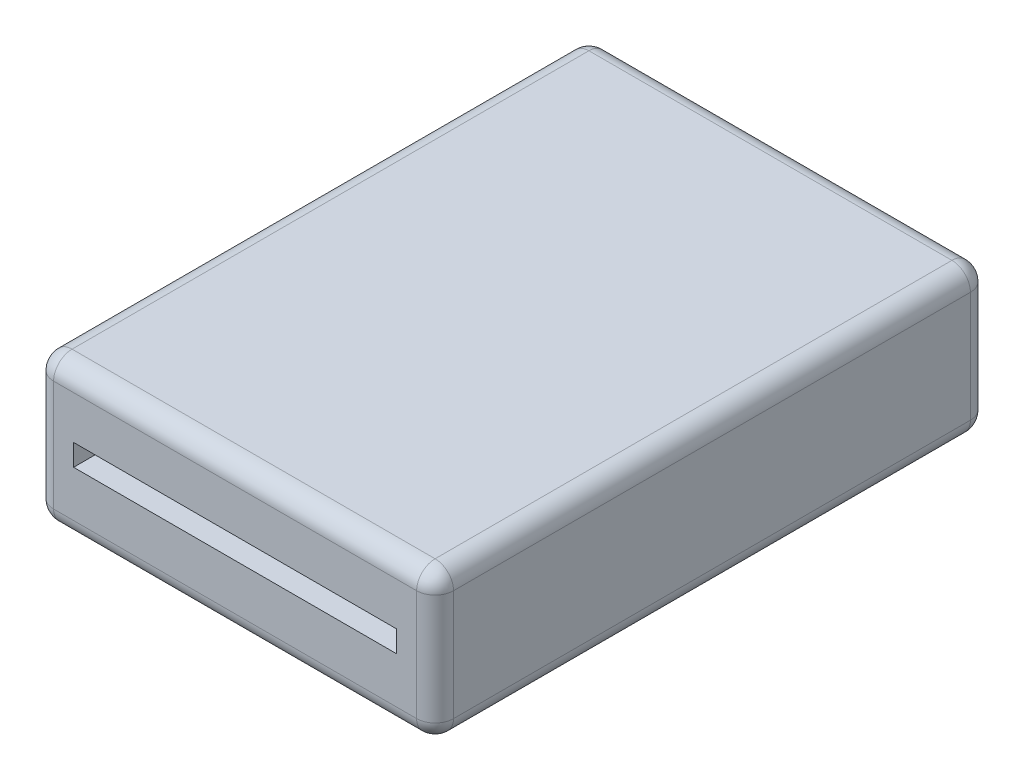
ISO-10303-21;
HEADER;
FILE_DESCRIPTION(('STEP AP214'),'2;1');
FILE_NAME('part.step','',(''),(''),'','','');
FILE_SCHEMA(('AUTOMOTIVE_DESIGN { 1 0 10303 214 1 1 1 1 }'));
ENDSEC;
DATA;
#1=APPLICATION_CONTEXT('core data for automotive mechanical design processes');
#2=APPLICATION_PROTOCOL_DEFINITION('international standard','automotive_design',2000,#1);
#3=PRODUCT_CONTEXT('',#1,'mechanical');
#4=PRODUCT('Part','Part','',(#3));
#5=PRODUCT_RELATED_PRODUCT_CATEGORY('part','',(#4));
#6=PRODUCT_DEFINITION_FORMATION('','',#4);
#7=PRODUCT_DEFINITION_CONTEXT('part definition',#1,'design');
#8=PRODUCT_DEFINITION('design','',#6,#7);
#9=PRODUCT_DEFINITION_SHAPE('','',#8);
#10=(LENGTH_UNIT() NAMED_UNIT(*) SI_UNIT(.MILLI.,.METRE.));
#11=(NAMED_UNIT(*) PLANE_ANGLE_UNIT() SI_UNIT($,.RADIAN.));
#12=(NAMED_UNIT(*) SI_UNIT($,.STERADIAN.) SOLID_ANGLE_UNIT());
#13=UNCERTAINTY_MEASURE_WITH_UNIT(LENGTH_MEASURE(1.E-05),#10,'distance_accuracy_value','');
#14=(GEOMETRIC_REPRESENTATION_CONTEXT(3) GLOBAL_UNCERTAINTY_ASSIGNED_CONTEXT((#13)) GLOBAL_UNIT_ASSIGNED_CONTEXT((#10,
#11,#12)) REPRESENTATION_CONTEXT('',''));
#15=CARTESIAN_POINT('',(0.,0.,0.));
#16=DIRECTION('',(0.,0.,1.));
#17=DIRECTION('',(1.,0.,0.));
#18=AXIS2_PLACEMENT_3D('',#15,#16,#17);
#19=CARTESIAN_POINT('',(29.5,24.,-42.));
#20=DIRECTION('',(0.,-1.,0.));
#21=DIRECTION('',(0.,0.,-1.));
#22=AXIS2_PLACEMENT_3D('',#19,#20,#21);
#23=CYLINDRICAL_SURFACE('',#22,3.);
#24=DIRECTION('',(0.,-1.,0.));
#25=VECTOR('',#24,1.);
#26=CARTESIAN_POINT('',(32.5,24.,-42.));
#27=LINE('',#26,#25);
#28=CARTESIAN_POINT('',(32.5,21.,-42.));
#29=VERTEX_POINT('',#28);
#30=CARTESIAN_POINT('',(32.5,3.,-42.));
#31=VERTEX_POINT('',#30);
#32=EDGE_CURVE('E187',#29,#31,#27,.T.);
#33=ORIENTED_EDGE('',*,*,#32,.T.);
#34=CARTESIAN_POINT('',(29.5,3.,-42.));
#35=DIRECTION('',(0.,-1.,0.));
#36=DIRECTION('',(0.,0.,-1.));
#37=AXIS2_PLACEMENT_3D('',#34,#35,#36);
#38=CIRCLE('',#37,3.);
#39=CARTESIAN_POINT('',(29.5,3.,-45.));
#40=VERTEX_POINT('',#39);
#41=EDGE_CURVE('E253',#31,#40,#38,.F.);
#42=ORIENTED_EDGE('',*,*,#41,.T.);
#43=DIRECTION('',(0.,-1.,0.));
#44=VECTOR('',#43,1.);
#45=CARTESIAN_POINT('',(29.5,24.,-45.));
#46=LINE('',#45,#44);
#47=CARTESIAN_POINT('',(29.5,21.,-45.));
#48=VERTEX_POINT('',#47);
#49=EDGE_CURVE('E209',#48,#40,#46,.T.);
#50=ORIENTED_EDGE('',*,*,#49,.F.);
#51=CARTESIAN_POINT('',(29.5,21.,-42.));
#52=DIRECTION('',(0.,-1.,0.));
#53=DIRECTION('',(0.,0.,-1.));
#54=AXIS2_PLACEMENT_3D('',#51,#52,#53);
#55=CIRCLE('',#54,3.);
#56=EDGE_CURVE('E251',#48,#29,#55,.T.);
#57=ORIENTED_EDGE('',*,*,#56,.T.);
#58=EDGE_LOOP('',(#33,#42,#50,#57));
#59=FACE_BOUND('',#58,.T.);
#60=ADVANCED_FACE('F34',(#59),#23,.T.);
#61=CARTESIAN_POINT('',(-29.5,24.,-45.));
#62=DIRECTION('',(0.,0.,1.));
#63=DIRECTION('',(1.,0.,0.));
#64=AXIS2_PLACEMENT_3D('',#61,#62,#63);
#65=PLANE('',#64);
#66=ORIENTED_EDGE('',*,*,#49,.T.);
#67=DIRECTION('',(-1.,0.,0.));
#68=VECTOR('',#67,1.);
#69=CARTESIAN_POINT('',(-29.5,3.,-45.));
#70=LINE('',#69,#68);
#71=CARTESIAN_POINT('',(-29.5,3.,-45.));
#72=VERTEX_POINT('',#71);
#73=EDGE_CURVE('E214',#40,#72,#70,.T.);
#74=ORIENTED_EDGE('',*,*,#73,.T.);
#75=DIRECTION('',(0.,-1.,0.));
#76=VECTOR('',#75,1.);
#77=CARTESIAN_POINT('',(-29.5,24.,-45.));
#78=LINE('',#77,#76);
#79=CARTESIAN_POINT('',(-29.5,21.,-45.));
#80=VERTEX_POINT('',#79);
#81=EDGE_CURVE('E206',#80,#72,#78,.T.);
#82=ORIENTED_EDGE('',*,*,#81,.F.);
#83=DIRECTION('',(-1.,0.,0.));
#84=VECTOR('',#83,1.);
#85=CARTESIAN_POINT('',(29.5,21.,-45.));
#86=LINE('',#85,#84);
#87=EDGE_CURVE('E212',#80,#48,#86,.F.);
#88=ORIENTED_EDGE('',*,*,#87,.T.);
#89=EDGE_LOOP('',(#66,#74,#82,#88));
#90=FACE_BOUND('',#89,.T.);
#91=ADVANCED_FACE('F325',(#90),#65,.F.);
#92=CARTESIAN_POINT('',(-29.5,24.,-42.));
#93=DIRECTION('',(0.,-1.,0.));
#94=DIRECTION('',(0.,0.,-1.));
#95=AXIS2_PLACEMENT_3D('',#92,#93,#94);
#96=CYLINDRICAL_SURFACE('',#95,3.);
#97=ORIENTED_EDGE('',*,*,#81,.T.);
#98=CARTESIAN_POINT('',(-29.5,3.,-42.));
#99=DIRECTION('',(0.,-1.,0.));
#100=DIRECTION('',(0.,0.,-1.));
#101=AXIS2_PLACEMENT_3D('',#98,#99,#100);
#102=CIRCLE('',#101,3.);
#103=CARTESIAN_POINT('',(-32.5,3.,-42.));
#104=VERTEX_POINT('',#103);
#105=EDGE_CURVE('E228',#72,#104,#102,.F.);
#106=ORIENTED_EDGE('',*,*,#105,.T.);
#107=DIRECTION('',(0.,-1.,0.));
#108=VECTOR('',#107,1.);
#109=CARTESIAN_POINT('',(-32.5,24.,-42.));
#110=LINE('',#109,#108);
#111=CARTESIAN_POINT('',(-32.5,21.,-42.));
#112=VERTEX_POINT('',#111);
#113=EDGE_CURVE('E203',#112,#104,#110,.T.);
#114=ORIENTED_EDGE('',*,*,#113,.F.);
#115=CARTESIAN_POINT('',(-29.5,21.,-42.));
#116=DIRECTION('',(0.,-1.,0.));
#117=DIRECTION('',(0.,0.,-1.));
#118=AXIS2_PLACEMENT_3D('',#115,#116,#117);
#119=CIRCLE('',#118,3.);
#120=EDGE_CURVE('E226',#112,#80,#119,.T.);
#121=ORIENTED_EDGE('',*,*,#120,.T.);
#122=EDGE_LOOP('',(#97,#106,#114,#121));
#123=FACE_BOUND('',#122,.T.);
#124=ADVANCED_FACE('F316',(#123),#96,.T.);
#125=CARTESIAN_POINT('',(-32.5,24.,42.));
#126=DIRECTION('',(1.,0.,0.));
#127=DIRECTION('',(0.,0.,-1.));
#128=AXIS2_PLACEMENT_3D('',#125,#126,#127);
#129=PLANE('',#128);
#130=ORIENTED_EDGE('',*,*,#113,.T.);
#131=DIRECTION('',(0.,0.,1.));
#132=VECTOR('',#131,1.);
#133=CARTESIAN_POINT('',(-32.5,3.,42.));
#134=LINE('',#133,#132);
#135=CARTESIAN_POINT('',(-32.5,3.,42.));
#136=VERTEX_POINT('',#135);
#137=EDGE_CURVE('E232',#104,#136,#134,.T.);
#138=ORIENTED_EDGE('',*,*,#137,.T.);
#139=DIRECTION('',(0.,-1.,0.));
#140=VECTOR('',#139,1.);
#141=CARTESIAN_POINT('',(-32.5,24.,42.));
#142=LINE('',#141,#140);
#143=CARTESIAN_POINT('',(-32.5,21.,42.));
#144=VERTEX_POINT('',#143);
#145=EDGE_CURVE('E200',#144,#136,#142,.T.);
#146=ORIENTED_EDGE('',*,*,#145,.F.);
#147=DIRECTION('',(0.,0.,1.));
#148=VECTOR('',#147,1.);
#149=CARTESIAN_POINT('',(-32.5,21.,-42.));
#150=LINE('',#149,#148);
#151=EDGE_CURVE('E230',#144,#112,#150,.F.);
#152=ORIENTED_EDGE('',*,*,#151,.T.);
#153=EDGE_LOOP('',(#130,#138,#146,#152));
#154=FACE_BOUND('',#153,.T.);
#155=ADVANCED_FACE('F313',(#154),#129,.F.);
#156=CARTESIAN_POINT('',(-29.5,24.,42.));
#157=DIRECTION('',(0.,-1.,0.));
#158=DIRECTION('',(0.,0.,-1.));
#159=AXIS2_PLACEMENT_3D('',#156,#157,#158);
#160=CYLINDRICAL_SURFACE('',#159,3.);
#161=ORIENTED_EDGE('',*,*,#145,.T.);
#162=CARTESIAN_POINT('',(-29.5,3.,42.));
#163=DIRECTION('',(0.,-1.,0.));
#164=DIRECTION('',(0.,0.,-1.));
#165=AXIS2_PLACEMENT_3D('',#162,#163,#164);
#166=CIRCLE('',#165,3.);
#167=CARTESIAN_POINT('',(-29.5,3.,45.));
#168=VERTEX_POINT('',#167);
#169=EDGE_CURVE('E236',#136,#168,#166,.F.);
#170=ORIENTED_EDGE('',*,*,#169,.T.);
#171=DIRECTION('',(0.,-1.,0.));
#172=VECTOR('',#171,1.);
#173=CARTESIAN_POINT('',(-29.5,24.,45.));
#174=LINE('',#173,#172);
#175=CARTESIAN_POINT('',(-29.5,21.,45.));
#176=VERTEX_POINT('',#175);
#177=EDGE_CURVE('E197',#176,#168,#174,.T.);
#178=ORIENTED_EDGE('',*,*,#177,.F.);
#179=CARTESIAN_POINT('',(-29.5,21.,42.));
#180=DIRECTION('',(0.,-1.,0.));
#181=DIRECTION('',(0.,0.,-1.));
#182=AXIS2_PLACEMENT_3D('',#179,#180,#181);
#183=CIRCLE('',#182,3.);
#184=EDGE_CURVE('E234',#176,#144,#183,.T.);
#185=ORIENTED_EDGE('',*,*,#184,.T.);
#186=EDGE_LOOP('',(#161,#170,#178,#185));
#187=FACE_BOUND('',#186,.T.);
#188=ADVANCED_FACE('F342',(#187),#160,.T.);
#189=CARTESIAN_POINT('',(-29.5,24.,45.));
#190=DIRECTION('',(0.,0.,-1.));
#191=DIRECTION('',(-1.,0.,0.));
#192=AXIS2_PLACEMENT_3D('',#189,#190,#191);
#193=PLANE('',#192);
#194=DIRECTION('',(-1.,0.,0.));
#195=VECTOR('',#194,1.);
#196=CARTESIAN_POINT('',(-26.25,13.9987751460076,45.));
#197=LINE('',#196,#195);
#198=CARTESIAN_POINT('',(26.25,13.9987751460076,45.));
#199=VERTEX_POINT('',#198);
#200=CARTESIAN_POINT('',(-26.25,13.9987751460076,45.));
#201=VERTEX_POINT('',#200);
#202=EDGE_CURVE('E177',#199,#201,#197,.T.);
#203=ORIENTED_EDGE('',*,*,#202,.F.);
#204=DIRECTION('',(0.,1.,0.));
#205=VECTOR('',#204,1.);
#206=CARTESIAN_POINT('',(26.25,13.9987751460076,45.));
#207=LINE('',#206,#205);
#208=CARTESIAN_POINT('',(26.25,10.4987751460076,45.));
#209=VERTEX_POINT('',#208);
#210=EDGE_CURVE('E51',#209,#199,#207,.T.);
#211=ORIENTED_EDGE('',*,*,#210,.F.);
#212=DIRECTION('',(1.,0.,0.));
#213=VECTOR('',#212,1.);
#214=CARTESIAN_POINT('',(-26.25,10.4987751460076,45.));
#215=LINE('',#214,#213);
#216=CARTESIAN_POINT('',(-26.25,10.4987751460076,45.));
#217=VERTEX_POINT('',#216);
#218=EDGE_CURVE('E168',#217,#209,#215,.T.);
#219=ORIENTED_EDGE('',*,*,#218,.F.);
#220=DIRECTION('',(0.,-1.,0.));
#221=VECTOR('',#220,1.);
#222=CARTESIAN_POINT('',(-26.25,13.9987751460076,45.));
#223=LINE('',#222,#221);
#224=EDGE_CURVE('E171',#201,#217,#223,.T.);
#225=ORIENTED_EDGE('',*,*,#224,.F.);
#226=EDGE_LOOP('',(#203,#211,#219,#225));
#227=FACE_BOUND('',#226,.T.);
#228=ORIENTED_EDGE('',*,*,#177,.T.);
#229=DIRECTION('',(1.,0.,0.));
#230=VECTOR('',#229,1.);
#231=CARTESIAN_POINT('',(-29.5,3.,45.));
#232=LINE('',#231,#230);
#233=CARTESIAN_POINT('',(29.5,3.,45.));
#234=VERTEX_POINT('',#233);
#235=EDGE_CURVE('E240',#168,#234,#232,.T.);
#236=ORIENTED_EDGE('',*,*,#235,.T.);
#237=DIRECTION('',(0.,-1.,0.));
#238=VECTOR('',#237,1.);
#239=CARTESIAN_POINT('',(29.5,24.,45.));
#240=LINE('',#239,#238);
#241=CARTESIAN_POINT('',(29.5,21.,45.));
#242=VERTEX_POINT('',#241);
#243=EDGE_CURVE('E194',#242,#234,#240,.T.);
#244=ORIENTED_EDGE('',*,*,#243,.F.);
#245=DIRECTION('',(1.,0.,0.));
#246=VECTOR('',#245,1.);
#247=CARTESIAN_POINT('',(-29.5,21.,45.));
#248=LINE('',#247,#246);
#249=EDGE_CURVE('E238',#242,#176,#248,.F.);
#250=ORIENTED_EDGE('',*,*,#249,.T.);
#251=EDGE_LOOP('',(#228,#236,#244,#250));
#252=FACE_BOUND('',#251,.T.);
#253=ADVANCED_FACE('F353',(#227,#252),#193,.F.);
#254=CARTESIAN_POINT('',(29.5,24.,42.));
#255=DIRECTION('',(0.,-1.,0.));
#256=DIRECTION('',(0.,0.,-1.));
#257=AXIS2_PLACEMENT_3D('',#254,#255,#256);
#258=CYLINDRICAL_SURFACE('',#257,3.);
#259=ORIENTED_EDGE('',*,*,#243,.T.);
#260=CARTESIAN_POINT('',(29.5,3.,42.));
#261=DIRECTION('',(0.,-1.,0.));
#262=DIRECTION('',(0.,0.,-1.));
#263=AXIS2_PLACEMENT_3D('',#260,#261,#262);
#264=CIRCLE('',#263,3.);
#265=CARTESIAN_POINT('',(32.5,3.,42.));
#266=VERTEX_POINT('',#265);
#267=EDGE_CURVE('E244',#234,#266,#264,.F.);
#268=ORIENTED_EDGE('',*,*,#267,.T.);
#269=DIRECTION('',(0.,-1.,0.));
#270=VECTOR('',#269,1.);
#271=CARTESIAN_POINT('',(32.5,24.,42.));
#272=LINE('',#271,#270);
#273=CARTESIAN_POINT('',(32.5,21.,42.));
#274=VERTEX_POINT('',#273);
#275=EDGE_CURVE('E190',#274,#266,#272,.T.);
#276=ORIENTED_EDGE('',*,*,#275,.F.);
#277=CARTESIAN_POINT('',(29.5,21.,42.));
#278=DIRECTION('',(0.,-1.,0.));
#279=DIRECTION('',(0.,0.,-1.));
#280=AXIS2_PLACEMENT_3D('',#277,#278,#279);
#281=CIRCLE('',#280,3.);
#282=EDGE_CURVE('E242',#274,#242,#281,.T.);
#283=ORIENTED_EDGE('',*,*,#282,.T.);
#284=EDGE_LOOP('',(#259,#268,#276,#283));
#285=FACE_BOUND('',#284,.T.);
#286=ADVANCED_FACE('F356',(#285),#258,.T.);
#287=CARTESIAN_POINT('',(32.5,24.,42.));
#288=DIRECTION('',(-1.,0.,0.));
#289=DIRECTION('',(0.,0.,1.));
#290=AXIS2_PLACEMENT_3D('',#287,#288,#289);
#291=PLANE('',#290);
#292=ORIENTED_EDGE('',*,*,#275,.T.);
#293=DIRECTION('',(0.,0.,-1.));
#294=VECTOR('',#293,1.);
#295=CARTESIAN_POINT('',(32.5,3.,42.));
#296=LINE('',#295,#294);
#297=EDGE_CURVE('E249',#266,#31,#296,.T.);
#298=ORIENTED_EDGE('',*,*,#297,.T.);
#299=ORIENTED_EDGE('',*,*,#32,.F.);
#300=DIRECTION('',(0.,0.,-1.));
#301=VECTOR('',#300,1.);
#302=CARTESIAN_POINT('',(32.5,21.,42.));
#303=LINE('',#302,#301);
#304=EDGE_CURVE('E246',#29,#274,#303,.F.);
#305=ORIENTED_EDGE('',*,*,#304,.T.);
#306=EDGE_LOOP('',(#292,#298,#299,#305));
#307=FACE_BOUND('',#306,.T.);
#308=ADVANCED_FACE('F366',(#307),#291,.F.);
#309=CARTESIAN_POINT('',(29.5,24.,-42.));
#310=DIRECTION('',(0.,1.,0.));
#311=DIRECTION('',(0.,0.,1.));
#312=AXIS2_PLACEMENT_3D('',#309,#310,#311);
#313=PLANE('',#312);
#314=DIRECTION('',(1.,0.,0.));
#315=VECTOR('',#314,1.);
#316=CARTESIAN_POINT('',(29.5,24.,42.));
#317=LINE('',#316,#315);
#318=CARTESIAN_POINT('',(-29.5,24.,42.));
#319=VERTEX_POINT('',#318);
#320=CARTESIAN_POINT('',(29.5,24.,42.));
#321=VERTEX_POINT('',#320);
#322=EDGE_CURVE('E43',#319,#321,#317,.T.);
#323=ORIENTED_EDGE('',*,*,#322,.T.);
#324=DIRECTION('',(0.,0.,-1.));
#325=VECTOR('',#324,1.);
#326=CARTESIAN_POINT('',(29.5,24.,-42.));
#327=LINE('',#326,#325);
#328=CARTESIAN_POINT('',(29.5,24.,-42.));
#329=VERTEX_POINT('',#328);
#330=EDGE_CURVE('E11',#321,#329,#327,.T.);
#331=ORIENTED_EDGE('',*,*,#330,.T.);
#332=DIRECTION('',(-1.,0.,0.));
#333=VECTOR('',#332,1.);
#334=CARTESIAN_POINT('',(-29.5,24.,-42.));
#335=LINE('',#334,#333);
#336=CARTESIAN_POINT('',(-29.5,24.,-42.));
#337=VERTEX_POINT('',#336);
#338=EDGE_CURVE('E255',#329,#337,#335,.T.);
#339=ORIENTED_EDGE('',*,*,#338,.T.);
#340=DIRECTION('',(0.,0.,1.));
#341=VECTOR('',#340,1.);
#342=CARTESIAN_POINT('',(-29.5,24.,42.));
#343=LINE('',#342,#341);
#344=EDGE_CURVE('E257',#337,#319,#343,.T.);
#345=ORIENTED_EDGE('',*,*,#344,.T.);
#346=EDGE_LOOP('',(#323,#331,#339,#345));
#347=FACE_BOUND('',#346,.T.);
#348=ADVANCED_FACE('F379',(#347),#313,.T.);
#349=CARTESIAN_POINT('',(29.5,0.,-42.));
#350=DIRECTION('',(0.,1.,0.));
#351=DIRECTION('',(0.,0.,1.));
#352=AXIS2_PLACEMENT_3D('',#349,#350,#351);
#353=PLANE('',#352);
#354=DIRECTION('',(0.,0.,1.));
#355=VECTOR('',#354,1.);
#356=CARTESIAN_POINT('',(-29.5,0.,-42.));
#357=LINE('',#356,#355);
#358=CARTESIAN_POINT('',(-29.5,0.,42.));
#359=VERTEX_POINT('',#358);
#360=CARTESIAN_POINT('',(-29.5,0.,-42.));
#361=VERTEX_POINT('',#360);
#362=EDGE_CURVE('E221',#359,#361,#357,.F.);
#363=ORIENTED_EDGE('',*,*,#362,.T.);
#364=DIRECTION('',(-1.,0.,0.));
#365=VECTOR('',#364,1.);
#366=CARTESIAN_POINT('',(29.5,0.,-42.));
#367=LINE('',#366,#365);
#368=CARTESIAN_POINT('',(29.5,0.,-42.));
#369=VERTEX_POINT('',#368);
#370=EDGE_CURVE('E223',#361,#369,#367,.F.);
#371=ORIENTED_EDGE('',*,*,#370,.T.);
#372=DIRECTION('',(0.,0.,-1.));
#373=VECTOR('',#372,1.);
#374=CARTESIAN_POINT('',(29.5,0.,-42.));
#375=LINE('',#374,#373);
#376=CARTESIAN_POINT('',(29.5,0.,42.));
#377=VERTEX_POINT('',#376);
#378=EDGE_CURVE('E217',#369,#377,#375,.F.);
#379=ORIENTED_EDGE('',*,*,#378,.T.);
#380=DIRECTION('',(1.,0.,0.));
#381=VECTOR('',#380,1.);
#382=CARTESIAN_POINT('',(29.5,0.,42.));
#383=LINE('',#382,#381);
#384=EDGE_CURVE('E219',#377,#359,#383,.F.);
#385=ORIENTED_EDGE('',*,*,#384,.T.);
#386=EDGE_LOOP('',(#363,#371,#379,#385));
#387=FACE_BOUND('',#386,.T.);
#388=ADVANCED_FACE('F332',(#387),#353,.F.);
#389=CARTESIAN_POINT('',(-29.5,3.,42.));
#390=DIRECTION('',(1.,0.,0.));
#391=DIRECTION('',(0.,0.,-1.));
#392=AXIS2_PLACEMENT_3D('',#389,#390,#391);
#393=CYLINDRICAL_SURFACE('',#392,3.);
#394=CARTESIAN_POINT('',(29.5,3.,42.));
#395=DIRECTION('',(1.,0.,0.));
#396=DIRECTION('',(0.,0.,-1.));
#397=AXIS2_PLACEMENT_3D('',#394,#395,#396);
#398=CIRCLE('',#397,3.);
#399=EDGE_CURVE('E191',#234,#377,#398,.T.);
#400=ORIENTED_EDGE('',*,*,#399,.F.);
#401=ORIENTED_EDGE('',*,*,#235,.F.);
#402=CARTESIAN_POINT('',(-29.5,3.,42.));
#403=DIRECTION('',(-1.,0.,0.));
#404=DIRECTION('',(0.,0.,1.));
#405=AXIS2_PLACEMENT_3D('',#402,#403,#404);
#406=CIRCLE('',#405,3.);
#407=EDGE_CURVE('E276',#359,#168,#406,.T.);
#408=ORIENTED_EDGE('',*,*,#407,.F.);
#409=ORIENTED_EDGE('',*,*,#384,.F.);
#410=EDGE_LOOP('',(#400,#401,#408,#409));
#411=FACE_BOUND('',#410,.T.);
#412=ADVANCED_FACE('F349',(#411),#393,.T.);
#413=CARTESIAN_POINT('',(29.5,3.,42.));
#414=DIRECTION('',(0.,1.,0.));
#415=DIRECTION('',(0.,0.,1.));
#416=AXIS2_PLACEMENT_3D('',#413,#414,#415);
#417=SPHERICAL_SURFACE('',#416,3.);
#418=ORIENTED_EDGE('',*,*,#267,.F.);
#419=ORIENTED_EDGE('',*,*,#399,.T.);
#420=CARTESIAN_POINT('',(29.5,3.,42.));
#421=DIRECTION('',(0.,0.,-1.));
#422=DIRECTION('',(-1.,0.,0.));
#423=AXIS2_PLACEMENT_3D('',#420,#421,#422);
#424=CIRCLE('',#423,3.);
#425=EDGE_CURVE('E273',#266,#377,#424,.T.);
#426=ORIENTED_EDGE('',*,*,#425,.F.);
#427=EDGE_LOOP('',(#418,#419,#426));
#428=FACE_BOUND('',#427,.T.);
#429=ADVANCED_FACE('F414',(#428),#417,.T.);
#430=CARTESIAN_POINT('',(-29.5,3.,42.));
#431=DIRECTION('',(0.,1.,0.));
#432=DIRECTION('',(0.,0.,1.));
#433=AXIS2_PLACEMENT_3D('',#430,#431,#432);
#434=SPHERICAL_SURFACE('',#433,3.);
#435=ORIENTED_EDGE('',*,*,#407,.T.);
#436=ORIENTED_EDGE('',*,*,#169,.F.);
#437=CARTESIAN_POINT('',(-29.5,3.,42.));
#438=DIRECTION('',(0.,0.,-1.));
#439=DIRECTION('',(-1.,0.,0.));
#440=AXIS2_PLACEMENT_3D('',#437,#438,#439);
#441=CIRCLE('',#440,3.);
#442=EDGE_CURVE('E270',#359,#136,#441,.T.);
#443=ORIENTED_EDGE('',*,*,#442,.F.);
#444=EDGE_LOOP('',(#435,#436,#443));
#445=FACE_BOUND('',#444,.T.);
#446=ADVANCED_FACE('F345',(#445),#434,.T.);
#447=CARTESIAN_POINT('',(29.5,3.,42.));
#448=DIRECTION('',(0.,0.,-1.));
#449=DIRECTION('',(-1.,0.,0.));
#450=AXIS2_PLACEMENT_3D('',#447,#448,#449);
#451=CYLINDRICAL_SURFACE('',#450,3.);
#452=ORIENTED_EDGE('',*,*,#425,.T.);
#453=ORIENTED_EDGE('',*,*,#378,.F.);
#454=CARTESIAN_POINT('',(29.5,3.,-42.));
#455=DIRECTION('',(0.,0.,-1.));
#456=DIRECTION('',(-1.,0.,0.));
#457=AXIS2_PLACEMENT_3D('',#454,#455,#456);
#458=CIRCLE('',#457,3.);
#459=EDGE_CURVE('E267',#31,#369,#458,.T.);
#460=ORIENTED_EDGE('',*,*,#459,.F.);
#461=ORIENTED_EDGE('',*,*,#297,.F.);
#462=EDGE_LOOP('',(#452,#453,#460,#461));
#463=FACE_BOUND('',#462,.T.);
#464=ADVANCED_FACE('F408',(#463),#451,.T.);
#465=CARTESIAN_POINT('',(-29.5,3.,42.));
#466=DIRECTION('',(0.,0.,1.));
#467=DIRECTION('',(1.,0.,0.));
#468=AXIS2_PLACEMENT_3D('',#465,#466,#467);
#469=CYLINDRICAL_SURFACE('',#468,3.);
#470=ORIENTED_EDGE('',*,*,#442,.T.);
#471=ORIENTED_EDGE('',*,*,#137,.F.);
#472=CARTESIAN_POINT('',(-29.5,3.,-42.));
#473=DIRECTION('',(0.,0.,-1.));
#474=DIRECTION('',(-1.,0.,0.));
#475=AXIS2_PLACEMENT_3D('',#472,#473,#474);
#476=CIRCLE('',#475,3.);
#477=EDGE_CURVE('E264',#361,#104,#476,.T.);
#478=ORIENTED_EDGE('',*,*,#477,.F.);
#479=ORIENTED_EDGE('',*,*,#362,.F.);
#480=EDGE_LOOP('',(#470,#471,#478,#479));
#481=FACE_BOUND('',#480,.T.);
#482=ADVANCED_FACE('F338',(#481),#469,.T.);
#483=CARTESIAN_POINT('',(29.5,3.,-42.));
#484=DIRECTION('',(0.,1.,0.));
#485=DIRECTION('',(0.,0.,1.));
#486=AXIS2_PLACEMENT_3D('',#483,#484,#485);
#487=SPHERICAL_SURFACE('',#486,3.);
#488=ORIENTED_EDGE('',*,*,#41,.F.);
#489=ORIENTED_EDGE('',*,*,#459,.T.);
#490=CARTESIAN_POINT('',(29.5,3.,-42.));
#491=DIRECTION('',(-1.,0.,0.));
#492=DIRECTION('',(0.,0.,1.));
#493=AXIS2_PLACEMENT_3D('',#490,#491,#492);
#494=CIRCLE('',#493,3.);
#495=EDGE_CURVE('E262',#40,#369,#494,.T.);
#496=ORIENTED_EDGE('',*,*,#495,.F.);
#497=EDGE_LOOP('',(#488,#489,#496));
#498=FACE_BOUND('',#497,.T.);
#499=ADVANCED_FACE('F402',(#498),#487,.T.);
#500=CARTESIAN_POINT('',(-29.5,3.,-42.));
#501=DIRECTION('',(0.,1.,0.));
#502=DIRECTION('',(0.,0.,1.));
#503=AXIS2_PLACEMENT_3D('',#500,#501,#502);
#504=SPHERICAL_SURFACE('',#503,3.);
#505=ORIENTED_EDGE('',*,*,#477,.T.);
#506=ORIENTED_EDGE('',*,*,#105,.F.);
#507=CARTESIAN_POINT('',(-29.5,3.,-42.));
#508=DIRECTION('',(1.,0.,0.));
#509=DIRECTION('',(0.,0.,-1.));
#510=AXIS2_PLACEMENT_3D('',#507,#508,#509);
#511=CIRCLE('',#510,3.);
#512=EDGE_CURVE('E260',#361,#72,#511,.T.);
#513=ORIENTED_EDGE('',*,*,#512,.F.);
#514=EDGE_LOOP('',(#505,#506,#513));
#515=FACE_BOUND('',#514,.T.);
#516=ADVANCED_FACE('F321',(#515),#504,.T.);
#517=CARTESIAN_POINT('',(-29.5,3.,-42.));
#518=DIRECTION('',(-1.,0.,0.));
#519=DIRECTION('',(0.,0.,1.));
#520=AXIS2_PLACEMENT_3D('',#517,#518,#519);
#521=CYLINDRICAL_SURFACE('',#520,3.);
#522=ORIENTED_EDGE('',*,*,#495,.T.);
#523=ORIENTED_EDGE('',*,*,#370,.F.);
#524=ORIENTED_EDGE('',*,*,#512,.T.);
#525=ORIENTED_EDGE('',*,*,#73,.F.);
#526=EDGE_LOOP('',(#522,#523,#524,#525));
#527=FACE_BOUND('',#526,.T.);
#528=ADVANCED_FACE('F329',(#527),#521,.T.);
#529=CARTESIAN_POINT('',(-29.5,21.,-42.));
#530=DIRECTION('',(0.,0.,-1.));
#531=DIRECTION('',(-1.,0.,0.));
#532=AXIS2_PLACEMENT_3D('',#529,#530,#531);
#533=CYLINDRICAL_SURFACE('',#532,3.);
#534=CARTESIAN_POINT('',(-29.5,21.,-42.));
#535=DIRECTION('',(0.,0.,-1.));
#536=DIRECTION('',(-1.,0.,0.));
#537=AXIS2_PLACEMENT_3D('',#534,#535,#536);
#538=CIRCLE('',#537,3.);
#539=EDGE_CURVE('E295',#112,#337,#538,.T.);
#540=ORIENTED_EDGE('',*,*,#539,.F.);
#541=ORIENTED_EDGE('',*,*,#151,.F.);
#542=CARTESIAN_POINT('',(-29.5,21.,42.));
#543=DIRECTION('',(0.,0.,1.));
#544=DIRECTION('',(1.,0.,0.));
#545=AXIS2_PLACEMENT_3D('',#542,#543,#544);
#546=CIRCLE('',#545,3.);
#547=EDGE_CURVE('E38',#319,#144,#546,.T.);
#548=ORIENTED_EDGE('',*,*,#547,.F.);
#549=ORIENTED_EDGE('',*,*,#344,.F.);
#550=EDGE_LOOP('',(#540,#541,#548,#549));
#551=FACE_BOUND('',#550,.T.);
#552=ADVANCED_FACE('F36',(#551),#533,.T.);
#553=CARTESIAN_POINT('',(-29.5,21.,42.));
#554=DIRECTION('',(0.,1.,0.));
#555=DIRECTION('',(0.,0.,1.));
#556=AXIS2_PLACEMENT_3D('',#553,#554,#555);
#557=SPHERICAL_SURFACE('',#556,3.);
#558=ORIENTED_EDGE('',*,*,#547,.T.);
#559=ORIENTED_EDGE('',*,*,#184,.F.);
#560=CARTESIAN_POINT('',(-29.5,21.,42.));
#561=DIRECTION('',(1.,0.,0.));
#562=DIRECTION('',(0.,0.,-1.));
#563=AXIS2_PLACEMENT_3D('',#560,#561,#562);
#564=CIRCLE('',#563,3.);
#565=EDGE_CURVE('E293',#319,#176,#564,.T.);
#566=ORIENTED_EDGE('',*,*,#565,.F.);
#567=EDGE_LOOP('',(#558,#559,#566));
#568=FACE_BOUND('',#567,.T.);
#569=ADVANCED_FACE('F306',(#568),#557,.T.);
#570=CARTESIAN_POINT('',(-29.5,21.,-42.));
#571=DIRECTION('',(0.,1.,0.));
#572=DIRECTION('',(0.,0.,1.));
#573=AXIS2_PLACEMENT_3D('',#570,#571,#572);
#574=SPHERICAL_SURFACE('',#573,3.);
#575=ORIENTED_EDGE('',*,*,#120,.F.);
#576=ORIENTED_EDGE('',*,*,#539,.T.);
#577=CARTESIAN_POINT('',(-29.5,21.,-42.));
#578=DIRECTION('',(1.,0.,0.));
#579=DIRECTION('',(0.,0.,-1.));
#580=AXIS2_PLACEMENT_3D('',#577,#578,#579);
#581=CIRCLE('',#580,3.);
#582=EDGE_CURVE('E290',#80,#337,#581,.T.);
#583=ORIENTED_EDGE('',*,*,#582,.F.);
#584=EDGE_LOOP('',(#575,#576,#583));
#585=FACE_BOUND('',#584,.T.);
#586=ADVANCED_FACE('F431',(#585),#574,.T.);
#587=CARTESIAN_POINT('',(29.5,21.,42.));
#588=DIRECTION('',(-1.,0.,0.));
#589=DIRECTION('',(0.,0.,1.));
#590=AXIS2_PLACEMENT_3D('',#587,#588,#589);
#591=CYLINDRICAL_SURFACE('',#590,3.);
#592=ORIENTED_EDGE('',*,*,#565,.T.);
#593=ORIENTED_EDGE('',*,*,#249,.F.);
#594=CARTESIAN_POINT('',(29.5,21.,42.));
#595=DIRECTION('',(1.,0.,0.));
#596=DIRECTION('',(0.,0.,-1.));
#597=AXIS2_PLACEMENT_3D('',#594,#595,#596);
#598=CIRCLE('',#597,3.);
#599=EDGE_CURVE('E287',#321,#242,#598,.T.);
#600=ORIENTED_EDGE('',*,*,#599,.F.);
#601=ORIENTED_EDGE('',*,*,#322,.F.);
#602=EDGE_LOOP('',(#592,#593,#600,#601));
#603=FACE_BOUND('',#602,.T.);
#604=ADVANCED_FACE('F428',(#603),#591,.T.);
#605=CARTESIAN_POINT('',(29.5,21.,-42.));
#606=DIRECTION('',(1.,0.,0.));
#607=DIRECTION('',(0.,0.,-1.));
#608=AXIS2_PLACEMENT_3D('',#605,#606,#607);
#609=CYLINDRICAL_SURFACE('',#608,3.);
#610=ORIENTED_EDGE('',*,*,#582,.T.);
#611=ORIENTED_EDGE('',*,*,#338,.F.);
#612=CARTESIAN_POINT('',(29.5,21.,-42.));
#613=DIRECTION('',(1.,0.,0.));
#614=DIRECTION('',(0.,0.,-1.));
#615=AXIS2_PLACEMENT_3D('',#612,#613,#614);
#616=CIRCLE('',#615,3.);
#617=EDGE_CURVE('E284',#48,#329,#616,.T.);
#618=ORIENTED_EDGE('',*,*,#617,.F.);
#619=ORIENTED_EDGE('',*,*,#87,.F.);
#620=EDGE_LOOP('',(#610,#611,#618,#619));
#621=FACE_BOUND('',#620,.T.);
#622=ADVANCED_FACE('F378',(#621),#609,.T.);
#623=CARTESIAN_POINT('',(29.5,21.,42.));
#624=DIRECTION('',(0.,1.,0.));
#625=DIRECTION('',(0.,0.,1.));
#626=AXIS2_PLACEMENT_3D('',#623,#624,#625);
#627=SPHERICAL_SURFACE('',#626,3.);
#628=ORIENTED_EDGE('',*,*,#599,.T.);
#629=ORIENTED_EDGE('',*,*,#282,.F.);
#630=CARTESIAN_POINT('',(29.5,21.,42.));
#631=DIRECTION('',(0.,0.,-1.));
#632=DIRECTION('',(-1.,0.,0.));
#633=AXIS2_PLACEMENT_3D('',#630,#631,#632);
#634=CIRCLE('',#633,3.);
#635=EDGE_CURVE('E282',#321,#274,#634,.T.);
#636=ORIENTED_EDGE('',*,*,#635,.F.);
#637=EDGE_LOOP('',(#628,#629,#636));
#638=FACE_BOUND('',#637,.T.);
#639=ADVANCED_FACE('F361',(#638),#627,.T.);
#640=CARTESIAN_POINT('',(29.5,21.,-42.));
#641=DIRECTION('',(0.,1.,0.));
#642=DIRECTION('',(0.,0.,1.));
#643=AXIS2_PLACEMENT_3D('',#640,#641,#642);
#644=SPHERICAL_SURFACE('',#643,3.);
#645=ORIENTED_EDGE('',*,*,#56,.F.);
#646=ORIENTED_EDGE('',*,*,#617,.T.);
#647=CARTESIAN_POINT('',(29.5,21.,-42.));
#648=DIRECTION('',(0.,0.,1.));
#649=DIRECTION('',(1.,0.,0.));
#650=AXIS2_PLACEMENT_3D('',#647,#648,#649);
#651=CIRCLE('',#650,3.);
#652=EDGE_CURVE('E183',#29,#329,#651,.T.);
#653=ORIENTED_EDGE('',*,*,#652,.F.);
#654=EDGE_LOOP('',(#645,#646,#653));
#655=FACE_BOUND('',#654,.T.);
#656=ADVANCED_FACE('F373',(#655),#644,.T.);
#657=CARTESIAN_POINT('',(29.5,21.,-42.));
#658=DIRECTION('',(0.,0.,1.));
#659=DIRECTION('',(1.,0.,0.));
#660=AXIS2_PLACEMENT_3D('',#657,#658,#659);
#661=CYLINDRICAL_SURFACE('',#660,3.);
#662=ORIENTED_EDGE('',*,*,#635,.T.);
#663=ORIENTED_EDGE('',*,*,#304,.F.);
#664=ORIENTED_EDGE('',*,*,#652,.T.);
#665=ORIENTED_EDGE('',*,*,#330,.F.);
#666=EDGE_LOOP('',(#662,#663,#664,#665));
#667=FACE_BOUND('',#666,.T.);
#668=ADVANCED_FACE('F370',(#667),#661,.T.);
#669=CARTESIAN_POINT('',(26.25,13.9987751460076,5.));
#670=DIRECTION('',(1.,0.,0.));
#671=DIRECTION('',(0.,1.,0.));
#672=AXIS2_PLACEMENT_3D('',#669,#670,#671);
#673=PLANE('',#672);
#674=ORIENTED_EDGE('',*,*,#210,.T.);
#675=DIRECTION('',(0.,0.,1.));
#676=VECTOR('',#675,1.);
#677=CARTESIAN_POINT('',(26.25,13.9987751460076,5.));
#678=LINE('',#677,#676);
#679=CARTESIAN_POINT('',(26.25,13.9987751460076,5.));
#680=VERTEX_POINT('',#679);
#681=EDGE_CURVE('E146',#680,#199,#678,.T.);
#682=ORIENTED_EDGE('',*,*,#681,.F.);
#683=DIRECTION('',(0.,1.,0.));
#684=VECTOR('',#683,1.);
#685=CARTESIAN_POINT('',(26.25,13.9987751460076,5.));
#686=LINE('',#685,#684);
#687=CARTESIAN_POINT('',(26.25,10.4987751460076,5.));
#688=VERTEX_POINT('',#687);
#689=EDGE_CURVE('E150',#688,#680,#686,.T.);
#690=ORIENTED_EDGE('',*,*,#689,.F.);
#691=DIRECTION('',(0.,0.,1.));
#692=VECTOR('',#691,1.);
#693=CARTESIAN_POINT('',(26.25,10.4987751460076,5.));
#694=LINE('',#693,#692);
#695=EDGE_CURVE('E181',#688,#209,#694,.T.);
#696=ORIENTED_EDGE('',*,*,#695,.T.);
#697=EDGE_LOOP('',(#674,#682,#690,#696));
#698=FACE_BOUND('',#697,.T.);
#699=ADVANCED_FACE('F148',(#698),#673,.F.);
#700=CARTESIAN_POINT('',(-26.25,10.4987751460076,5.));
#701=DIRECTION('',(0.,-1.,0.));
#702=DIRECTION('',(0.,0.,-1.));
#703=AXIS2_PLACEMENT_3D('',#700,#701,#702);
#704=PLANE('',#703);
#705=ORIENTED_EDGE('',*,*,#218,.T.);
#706=ORIENTED_EDGE('',*,*,#695,.F.);
#707=DIRECTION('',(1.,0.,0.));
#708=VECTOR('',#707,1.);
#709=CARTESIAN_POINT('',(-26.25,10.4987751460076,5.));
#710=LINE('',#709,#708);
#711=CARTESIAN_POINT('',(-26.25,10.4987751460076,5.));
#712=VERTEX_POINT('',#711);
#713=EDGE_CURVE('E156',#712,#688,#710,.T.);
#714=ORIENTED_EDGE('',*,*,#713,.F.);
#715=DIRECTION('',(0.,0.,1.));
#716=VECTOR('',#715,1.);
#717=CARTESIAN_POINT('',(-26.25,10.4987751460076,5.));
#718=LINE('',#717,#716);
#719=EDGE_CURVE('E184',#712,#217,#718,.T.);
#720=ORIENTED_EDGE('',*,*,#719,.T.);
#721=EDGE_LOOP('',(#705,#706,#714,#720));
#722=FACE_BOUND('',#721,.T.);
#723=ADVANCED_FACE('F542',(#722),#704,.F.);
#724=CARTESIAN_POINT('',(-26.25,13.9987751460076,5.));
#725=DIRECTION('',(-1.,0.,0.));
#726=DIRECTION('',(0.,-1.,0.));
#727=AXIS2_PLACEMENT_3D('',#724,#725,#726);
#728=PLANE('',#727);
#729=ORIENTED_EDGE('',*,*,#224,.T.);
#730=ORIENTED_EDGE('',*,*,#719,.F.);
#731=DIRECTION('',(0.,-1.,0.));
#732=VECTOR('',#731,1.);
#733=CARTESIAN_POINT('',(-26.25,13.9987751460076,5.));
#734=LINE('',#733,#732);
#735=CARTESIAN_POINT('',(-26.25,13.9987751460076,5.));
#736=VERTEX_POINT('',#735);
#737=EDGE_CURVE('E164',#736,#712,#734,.T.);
#738=ORIENTED_EDGE('',*,*,#737,.F.);
#739=DIRECTION('',(0.,0.,1.));
#740=VECTOR('',#739,1.);
#741=CARTESIAN_POINT('',(-26.25,13.9987751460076,5.));
#742=LINE('',#741,#740);
#743=EDGE_CURVE('E155',#736,#201,#742,.T.);
#744=ORIENTED_EDGE('',*,*,#743,.T.);
#745=EDGE_LOOP('',(#729,#730,#738,#744));
#746=FACE_BOUND('',#745,.T.);
#747=ADVANCED_FACE('F540',(#746),#728,.F.);
#748=CARTESIAN_POINT('',(-26.25,13.9987751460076,5.));
#749=DIRECTION('',(0.,1.,0.));
#750=DIRECTION('',(-1.,0.,0.));
#751=AXIS2_PLACEMENT_3D('',#748,#749,#750);
#752=PLANE('',#751);
#753=ORIENTED_EDGE('',*,*,#202,.T.);
#754=ORIENTED_EDGE('',*,*,#743,.F.);
#755=DIRECTION('',(-1.,0.,0.));
#756=VECTOR('',#755,1.);
#757=CARTESIAN_POINT('',(-26.25,13.9987751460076,5.));
#758=LINE('',#757,#756);
#759=EDGE_CURVE('E159',#680,#736,#758,.T.);
#760=ORIENTED_EDGE('',*,*,#759,.F.);
#761=ORIENTED_EDGE('',*,*,#681,.T.);
#762=EDGE_LOOP('',(#753,#754,#760,#761));
#763=FACE_BOUND('',#762,.T.);
#764=ADVANCED_FACE('F160',(#763),#752,.F.);
#765=CARTESIAN_POINT('',(0.,0.,5.));
#766=DIRECTION('',(0.,0.,1.));
#767=DIRECTION('',(1.,0.,0.));
#768=AXIS2_PLACEMENT_3D('',#765,#766,#767);
#769=PLANE('',#768);
#770=ORIENTED_EDGE('',*,*,#689,.T.);
#771=ORIENTED_EDGE('',*,*,#759,.T.);
#772=ORIENTED_EDGE('',*,*,#737,.T.);
#773=ORIENTED_EDGE('',*,*,#713,.T.);
#774=EDGE_LOOP('',(#770,#771,#772,#773));
#775=FACE_BOUND('',#774,.T.);
#776=ADVANCED_FACE('F166',(#775),#769,.T.);
#777=CLOSED_SHELL('',(#60,#91,#124,#155,#188,#253,#286,#308,#348,#388,#412,#429,#446,#464,#482,
#499,#516,#528,#552,#569,#586,#604,#622,#639,#656,#668,#699,#723,#747,#764,#776));
#778=MANIFOLD_SOLID_BREP('B2',#777);
#779=ADVANCED_BREP_SHAPE_REPRESENTATION('',(#18,#778),#14);
#780=SHAPE_DEFINITION_REPRESENTATION(#9,#779);
ENDSEC;
END-ISO-10303-21;
